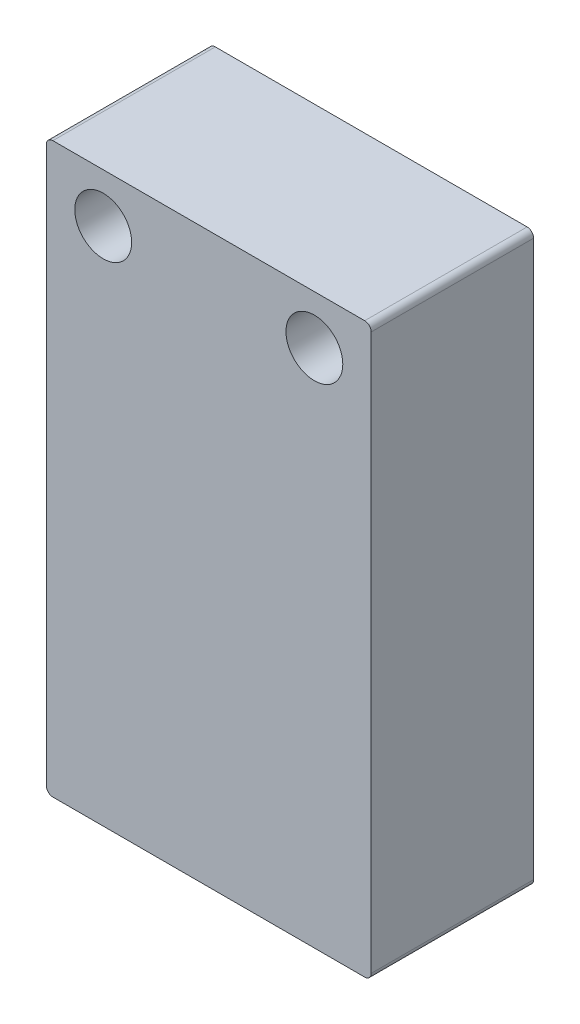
from build123d import *

# Parameters (mm, degrees)
ESQUISSE1_R      = 3.5
EXTRUSION1_DEPTH = 20


with BuildPart() as part:
    # Esquisse1 → Extrusion1 (new body)
    with BuildSketch(Plane.XY):
        with BuildLine():
            Line((0.8, 0), (39.2, 0))
            ThreePointArc((39.2, 0), (39.765685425, 0.234314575), (40, 0.8))
            Line((40, 0.8), (40, 69.2))
            ThreePointArc((40, 69.2), (39.765685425, 69.765685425), (39.2, 70))
            Line((39.2, 70), (0.8, 70))
            ThreePointArc((0.8, 70), (0.234314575, 69.765685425), (0, 69.2))
            Line((0, 69.2), (0, 0.8))
            ThreePointArc((0, 0.8), (0.234314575, 0.234314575), (0.8, 0))
        make_face()
        with Locations((7, 64)):
            Circle(ESQUISSE1_R, mode=Mode.SUBTRACT)
        with Locations((33, 64)):
            Circle(ESQUISSE1_R, mode=Mode.SUBTRACT)
    extrude(amount=-EXTRUSION1_DEPTH)


solid = part.part
